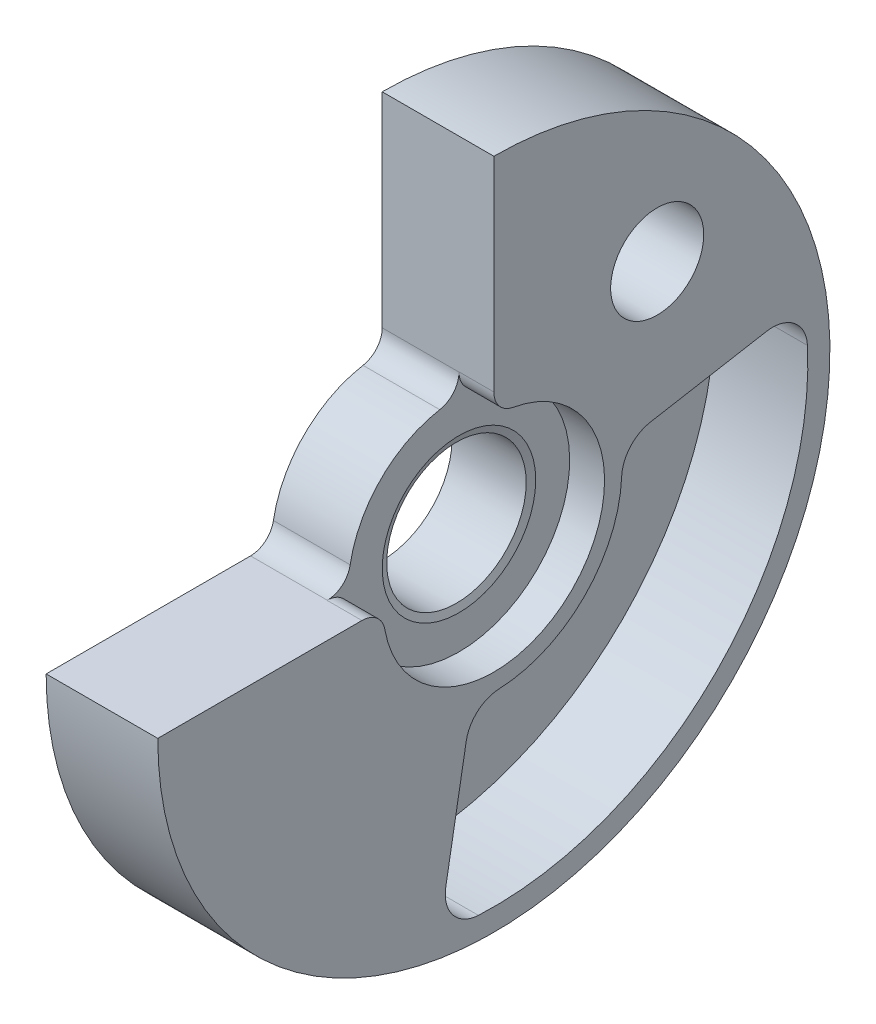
ISO-10303-21;
HEADER;
FILE_DESCRIPTION(('STEP AP214'),'2;1');
FILE_NAME('part.step','',(''),(''),'','','');
FILE_SCHEMA(('AUTOMOTIVE_DESIGN { 1 0 10303 214 1 1 1 1 }'));
ENDSEC;
DATA;
#1=APPLICATION_CONTEXT('core data for automotive mechanical design processes');
#2=APPLICATION_PROTOCOL_DEFINITION('international standard','automotive_design',2000,#1);
#3=PRODUCT_CONTEXT('',#1,'mechanical');
#4=PRODUCT('Part','Part','',(#3));
#5=PRODUCT_RELATED_PRODUCT_CATEGORY('part','',(#4));
#6=PRODUCT_DEFINITION_FORMATION('','',#4);
#7=PRODUCT_DEFINITION_CONTEXT('part definition',#1,'design');
#8=PRODUCT_DEFINITION('design','',#6,#7);
#9=PRODUCT_DEFINITION_SHAPE('','',#8);
#10=(LENGTH_UNIT() NAMED_UNIT(*) SI_UNIT(.MILLI.,.METRE.));
#11=(NAMED_UNIT(*) PLANE_ANGLE_UNIT() SI_UNIT($,.RADIAN.));
#12=(NAMED_UNIT(*) SI_UNIT($,.STERADIAN.) SOLID_ANGLE_UNIT());
#13=UNCERTAINTY_MEASURE_WITH_UNIT(LENGTH_MEASURE(1.E-05),#10,'distance_accuracy_value','');
#14=(GEOMETRIC_REPRESENTATION_CONTEXT(3) GLOBAL_UNCERTAINTY_ASSIGNED_CONTEXT((#13)) GLOBAL_UNIT_ASSIGNED_CONTEXT((#10,
#11,#12)) REPRESENTATION_CONTEXT('',''));
#15=CARTESIAN_POINT('',(0.,0.,0.));
#16=DIRECTION('',(0.,0.,1.));
#17=DIRECTION('',(1.,0.,0.));
#18=AXIS2_PLACEMENT_3D('',#15,#16,#17);
#19=CARTESIAN_POINT('',(0.,0.,0.));
#20=DIRECTION('',(1.,0.,0.));
#21=DIRECTION('',(0.,0.,-1.));
#22=AXIS2_PLACEMENT_3D('',#19,#20,#21);
#23=CYLINDRICAL_SURFACE('',#22,4.75);
#24=CARTESIAN_POINT('',(0.,0.,0.));
#25=DIRECTION('',(-1.,0.,0.));
#26=DIRECTION('',(0.,0.,-1.));
#27=AXIS2_PLACEMENT_3D('',#24,#25,#26);
#28=CIRCLE('',#27,4.75);
#29=CARTESIAN_POINT('',(0.,0.826086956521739,4.67761481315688));
#30=VERTEX_POINT('',#29);
#31=CARTESIAN_POINT('',(0.,4.67761481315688,0.826086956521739));
#32=VERTEX_POINT('',#31);
#33=EDGE_CURVE('E241',#30,#32,#28,.T.);
#34=ORIENTED_EDGE('',*,*,#33,.F.);
#35=DIRECTION('',(1.,0.,0.));
#36=VECTOR('',#35,1.);
#37=CARTESIAN_POINT('',(0.,0.826086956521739,4.67761481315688));
#38=LINE('',#37,#36);
#39=CARTESIAN_POINT('',(3.3,0.826086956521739,4.67761481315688));
#40=VERTEX_POINT('',#39);
#41=EDGE_CURVE('E270',#30,#40,#38,.T.);
#42=ORIENTED_EDGE('',*,*,#41,.T.);
#43=CARTESIAN_POINT('',(3.3,0.,0.));
#44=DIRECTION('',(1.,0.,0.));
#45=DIRECTION('',(0.,0.,-1.));
#46=AXIS2_PLACEMENT_3D('',#43,#44,#45);
#47=CIRCLE('',#46,4.75);
#48=CARTESIAN_POINT('',(3.3,4.67761481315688,0.826086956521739));
#49=VERTEX_POINT('',#48);
#50=EDGE_CURVE('E265',#49,#40,#47,.T.);
#51=ORIENTED_EDGE('',*,*,#50,.F.);
#52=DIRECTION('',(1.,0.,0.));
#53=VECTOR('',#52,1.);
#54=CARTESIAN_POINT('',(0.,4.67761481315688,0.826086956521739));
#55=LINE('',#54,#53);
#56=EDGE_CURVE('E268',#49,#32,#55,.F.);
#57=ORIENTED_EDGE('',*,*,#56,.T.);
#58=EDGE_LOOP('',(#34,#42,#51,#57));
#59=FACE_BOUND('',#58,.T.);
#60=ADVANCED_FACE('F35',(#59),#23,.T.);
#61=CARTESIAN_POINT('',(4.8,0.,0.));
#62=DIRECTION('',(-1.,0.,0.));
#63=DIRECTION('',(0.,0.,1.));
#64=AXIS2_PLACEMENT_3D('',#61,#62,#63);
#65=CYLINDRICAL_SURFACE('',#64,14.45);
#66=CARTESIAN_POINT('',(4.8,0.,0.));
#67=DIRECTION('',(1.,0.,0.));
#68=DIRECTION('',(0.,0.,-1.));
#69=AXIS2_PLACEMENT_3D('',#66,#67,#68);
#70=CIRCLE('',#69,14.45);
#71=CARTESIAN_POINT('',(4.8,0.,14.45));
#72=VERTEX_POINT('',#71);
#73=CARTESIAN_POINT('',(4.8,14.45,0.));
#74=VERTEX_POINT('',#73);
#75=EDGE_CURVE('E257',#72,#74,#70,.T.);
#76=ORIENTED_EDGE('',*,*,#75,.F.);
#77=DIRECTION('',(-1.,0.,0.));
#78=VECTOR('',#77,1.);
#79=CARTESIAN_POINT('',(4.8,0.,14.45));
#80=LINE('',#79,#78);
#81=CARTESIAN_POINT('',(0.,0.,14.45));
#82=VERTEX_POINT('',#81);
#83=EDGE_CURVE('E253',#72,#82,#80,.T.);
#84=ORIENTED_EDGE('',*,*,#83,.T.);
#85=CARTESIAN_POINT('',(0.,0.,0.));
#86=DIRECTION('',(1.,0.,0.));
#87=DIRECTION('',(0.,0.,-1.));
#88=AXIS2_PLACEMENT_3D('',#85,#86,#87);
#89=CIRCLE('',#88,14.45);
#90=CARTESIAN_POINT('',(0.,14.45,0.));
#91=VERTEX_POINT('',#90);
#92=EDGE_CURVE('E256',#82,#91,#89,.T.);
#93=ORIENTED_EDGE('',*,*,#92,.T.);
#94=DIRECTION('',(-1.,0.,0.));
#95=VECTOR('',#94,1.);
#96=CARTESIAN_POINT('',(4.8,14.45,0.));
#97=LINE('',#96,#95);
#98=EDGE_CURVE('E247',#91,#74,#97,.F.);
#99=ORIENTED_EDGE('',*,*,#98,.T.);
#100=EDGE_LOOP('',(#76,#84,#93,#99));
#101=FACE_BOUND('',#100,.T.);
#102=ADVANCED_FACE('F328',(#101),#65,.T.);
#103=CARTESIAN_POINT('',(4.8,0.,0.));
#104=DIRECTION('',(1.,0.,0.));
#105=DIRECTION('',(0.,0.,-1.));
#106=AXIS2_PLACEMENT_3D('',#103,#104,#105);
#107=PLANE('',#106);
#108=CARTESIAN_POINT('',(4.8,7.02157033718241,-7.02157033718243));
#109=DIRECTION('',(1.,0.,0.));
#110=DIRECTION('',(0.,0.,-1.));
#111=AXIS2_PLACEMENT_3D('',#108,#109,#110);
#112=CIRCLE('',#111,2.);
#113=CARTESIAN_POINT('',(4.8,7.02157033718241,-9.02157033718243));
#114=VERTEX_POINT('',#113);
#115=EDGE_CURVE('E583',#114,#114,#112,.T.);
#116=ORIENTED_EDGE('',*,*,#115,.F.);
#117=EDGE_LOOP('',(#116));
#118=FACE_BOUND('',#117,.T.);
#119=CARTESIAN_POINT('',(4.8,-11.9854760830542,0.590222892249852));
#120=DIRECTION('',(1.,0.,0.));
#121=DIRECTION('',(0.,0.,1.));
#122=AXIS2_PLACEMENT_3D('',#119,#120,#121);
#123=CIRCLE('',#122,1.5);
#124=CARTESIAN_POINT('',(4.8,-11.7250038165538,2.06743452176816));
#125=VERTEX_POINT('',#124);
#126=CARTESIAN_POINT('',(4.8,-13.483660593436,0.66400075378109));
#127=VERTEX_POINT('',#126);
#128=EDGE_CURVE('E50',#125,#127,#123,.T.);
#129=ORIENTED_EDGE('',*,*,#128,.F.);
#130=DIRECTION('',(0.,-0.984807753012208,0.173648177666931));
#131=VECTOR('',#130,1.);
#132=CARTESIAN_POINT('',(4.8,-6.73352173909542,1.18730155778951));
#133=LINE('',#132,#131);
#134=CARTESIAN_POINT('',(4.8,-6.73352173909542,1.18730155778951));
#135=VERTEX_POINT('',#134);
#136=EDGE_CURVE('E182',#135,#125,#133,.T.);
#137=ORIENTED_EDGE('',*,*,#136,.F.);
#138=CARTESIAN_POINT('',(4.8,-6.99399400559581,-0.289910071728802));
#139=DIRECTION('',(1.,0.,0.));
#140=DIRECTION('',(0.,0.,1.));
#141=AXIS2_PLACEMENT_3D('',#138,#139,#140);
#142=CIRCLE('',#141,1.5);
#143=CARTESIAN_POINT('',(4.8,-5.49528100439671,-0.227786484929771));
#144=VERTEX_POINT('',#143);
#145=EDGE_CURVE('E185',#144,#135,#142,.T.);
#146=ORIENTED_EDGE('',*,*,#145,.F.);
#147=CARTESIAN_POINT('',(4.8,0.,0.));
#148=DIRECTION('',(-1.,0.,0.));
#149=DIRECTION('',(0.,0.,-1.));
#150=AXIS2_PLACEMENT_3D('',#147,#148,#149);
#151=CIRCLE('',#150,5.5);
#152=CARTESIAN_POINT('',(4.8,-0.22778648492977,-5.49528100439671));
#153=VERTEX_POINT('',#152);
#154=EDGE_CURVE('E216',#153,#144,#151,.T.);
#155=ORIENTED_EDGE('',*,*,#154,.F.);
#156=CARTESIAN_POINT('',(4.8,-0.289910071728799,-6.99399400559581));
#157=DIRECTION('',(1.,0.,0.));
#158=DIRECTION('',(0.,0.,-1.));
#159=AXIS2_PLACEMENT_3D('',#156,#157,#158);
#160=CIRCLE('',#159,1.5);
#161=CARTESIAN_POINT('',(4.8,1.18730155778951,-6.73352173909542));
#162=VERTEX_POINT('',#161);
#163=EDGE_CURVE('E213',#162,#153,#160,.T.);
#164=ORIENTED_EDGE('',*,*,#163,.F.);
#165=DIRECTION('',(0.,-0.173648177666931,0.984807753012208));
#166=VECTOR('',#165,1.);
#167=CARTESIAN_POINT('',(4.8,1.18730155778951,-6.73352173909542));
#168=LINE('',#167,#166);
#169=CARTESIAN_POINT('',(4.8,2.06743452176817,-11.7250038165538));
#170=VERTEX_POINT('',#169);
#171=EDGE_CURVE('E210',#170,#162,#168,.T.);
#172=ORIENTED_EDGE('',*,*,#171,.F.);
#173=CARTESIAN_POINT('',(4.8,0.590222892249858,-11.9854760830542));
#174=DIRECTION('',(1.,0.,0.));
#175=DIRECTION('',(0.,0.,-1.));
#176=AXIS2_PLACEMENT_3D('',#173,#174,#175);
#177=CIRCLE('',#176,1.5);
#178=CARTESIAN_POINT('',(4.8,0.664000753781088,-13.483660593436));
#179=VERTEX_POINT('',#178);
#180=EDGE_CURVE('E207',#179,#170,#177,.T.);
#181=ORIENTED_EDGE('',*,*,#180,.F.);
#182=CARTESIAN_POINT('',(4.8,0.,0.));
#183=DIRECTION('',(1.,0.,0.));
#184=DIRECTION('',(0.,0.,-1.));
#185=AXIS2_PLACEMENT_3D('',#182,#183,#184);
#186=CIRCLE('',#185,13.5);
#187=EDGE_CURVE('E205',#127,#179,#186,.T.);
#188=ORIENTED_EDGE('',*,*,#187,.F.);
#189=EDGE_LOOP('',(#129,#137,#146,#155,#164,#172,#181,#188));
#190=FACE_BOUND('',#189,.T.);
#191=CARTESIAN_POINT('',(4.8,0.,0.));
#192=DIRECTION('',(1.,0.,0.));
#193=DIRECTION('',(0.,0.,-1.));
#194=AXIS2_PLACEMENT_3D('',#191,#192,#193);
#195=CIRCLE('',#194,4.76);
#196=CARTESIAN_POINT('',(4.8,-0.826388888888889,4.68771601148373));
#197=VERTEX_POINT('',#196);
#198=CARTESIAN_POINT('',(4.8,4.68771601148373,-0.826388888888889));
#199=VERTEX_POINT('',#198);
#200=EDGE_CURVE('E223',#197,#199,#195,.T.);
#201=ORIENTED_EDGE('',*,*,#200,.F.);
#202=CARTESIAN_POINT('',(4.8,-1.,5.67253029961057));
#203=DIRECTION('',(1.,0.,0.));
#204=DIRECTION('',(0.,0.,-1.));
#205=AXIS2_PLACEMENT_3D('',#202,#203,#204);
#206=CIRCLE('',#205,1.);
#207=CARTESIAN_POINT('',(4.8,0.,5.67253029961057));
#208=VERTEX_POINT('',#207);
#209=EDGE_CURVE('E293',#197,#208,#206,.T.);
#210=ORIENTED_EDGE('',*,*,#209,.T.);
#211=DIRECTION('',(0.,0.,-1.));
#212=VECTOR('',#211,1.);
#213=CARTESIAN_POINT('',(4.8,0.,4.75));
#214=LINE('',#213,#212);
#215=EDGE_CURVE('E245',#72,#208,#214,.T.);
#216=ORIENTED_EDGE('',*,*,#215,.F.);
#217=ORIENTED_EDGE('',*,*,#75,.T.);
#218=DIRECTION('',(0.,1.,0.));
#219=VECTOR('',#218,1.);
#220=CARTESIAN_POINT('',(4.8,4.75,0.));
#221=LINE('',#220,#219);
#222=CARTESIAN_POINT('',(4.8,5.67253029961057,0.));
#223=VERTEX_POINT('',#222);
#224=EDGE_CURVE('E238',#223,#74,#221,.T.);
#225=ORIENTED_EDGE('',*,*,#224,.F.);
#226=CARTESIAN_POINT('',(4.8,5.67253029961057,-1.));
#227=DIRECTION('',(1.,0.,0.));
#228=DIRECTION('',(0.,0.,-1.));
#229=AXIS2_PLACEMENT_3D('',#226,#227,#228);
#230=CIRCLE('',#229,1.);
#231=EDGE_CURVE('E291',#223,#199,#230,.T.);
#232=ORIENTED_EDGE('',*,*,#231,.T.);
#233=EDGE_LOOP('',(#201,#210,#216,#217,#225,#232));
#234=FACE_BOUND('',#233,.T.);
#235=ADVANCED_FACE('F334',(#118,#190,#234),#107,.T.);
#236=CARTESIAN_POINT('',(0.,0.,0.));
#237=DIRECTION('',(1.,0.,0.));
#238=DIRECTION('',(0.,0.,-1.));
#239=AXIS2_PLACEMENT_3D('',#236,#237,#238);
#240=PLANE('',#239);
#241=CARTESIAN_POINT('',(0.,7.02157033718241,-7.02157033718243));
#242=DIRECTION('',(1.,0.,0.));
#243=DIRECTION('',(0.,0.,-1.));
#244=AXIS2_PLACEMENT_3D('',#241,#242,#243);
#245=CIRCLE('',#244,2.);
#246=CARTESIAN_POINT('',(0.,7.02157033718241,-9.02157033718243));
#247=VERTEX_POINT('',#246);
#248=EDGE_CURVE('E580',#247,#247,#245,.T.);
#249=ORIENTED_EDGE('',*,*,#248,.T.);
#250=EDGE_LOOP('',(#249));
#251=FACE_BOUND('',#250,.T.);
#252=CARTESIAN_POINT('',(0.,0.,0.));
#253=DIRECTION('',(1.,0.,0.));
#254=DIRECTION('',(0.,0.,-1.));
#255=AXIS2_PLACEMENT_3D('',#252,#253,#254);
#256=CIRCLE('',#255,3.);
#257=CARTESIAN_POINT('',(0.,0.,-3.));
#258=VERTEX_POINT('',#257);
#259=EDGE_CURVE('E188',#258,#258,#256,.F.);
#260=ORIENTED_EDGE('',*,*,#259,.F.);
#261=EDGE_LOOP('',(#260));
#262=FACE_BOUND('',#261,.T.);
#263=ORIENTED_EDGE('',*,*,#92,.F.);
#264=DIRECTION('',(0.,0.,-1.));
#265=VECTOR('',#264,1.);
#266=CARTESIAN_POINT('',(0.,0.,0.));
#267=LINE('',#266,#265);
#268=CARTESIAN_POINT('',(0.,0.,5.66237582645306));
#269=VERTEX_POINT('',#268);
#270=EDGE_CURVE('E260',#82,#269,#267,.T.);
#271=ORIENTED_EDGE('',*,*,#270,.T.);
#272=CARTESIAN_POINT('',(0.,1.,5.66237582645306));
#273=DIRECTION('',(1.,0.,0.));
#274=DIRECTION('',(0.,0.,-1.));
#275=AXIS2_PLACEMENT_3D('',#272,#273,#274);
#276=CIRCLE('',#275,1.);
#277=EDGE_CURVE('E280',#269,#30,#276,.T.);
#278=ORIENTED_EDGE('',*,*,#277,.T.);
#279=ORIENTED_EDGE('',*,*,#33,.T.);
#280=CARTESIAN_POINT('',(0.,5.66237582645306,1.));
#281=DIRECTION('',(1.,0.,0.));
#282=DIRECTION('',(0.,0.,-1.));
#283=AXIS2_PLACEMENT_3D('',#280,#281,#282);
#284=CIRCLE('',#283,1.);
#285=CARTESIAN_POINT('',(0.,5.66237582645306,0.));
#286=VERTEX_POINT('',#285);
#287=EDGE_CURVE('E283',#32,#286,#284,.T.);
#288=ORIENTED_EDGE('',*,*,#287,.T.);
#289=DIRECTION('',(0.,1.,0.));
#290=VECTOR('',#289,1.);
#291=CARTESIAN_POINT('',(0.,4.75,0.));
#292=LINE('',#291,#290);
#293=EDGE_CURVE('E244',#286,#91,#292,.T.);
#294=ORIENTED_EDGE('',*,*,#293,.T.);
#295=EDGE_LOOP('',(#263,#271,#278,#279,#288,#294));
#296=FACE_BOUND('',#295,.T.);
#297=ADVANCED_FACE('F344',(#251,#262,#296),#240,.F.);
#298=CARTESIAN_POINT('',(0.,0.,4.75));
#299=DIRECTION('',(0.,-1.,0.));
#300=DIRECTION('',(0.,0.,-1.));
#301=AXIS2_PLACEMENT_3D('',#298,#299,#300);
#302=PLANE('',#301);
#303=ORIENTED_EDGE('',*,*,#215,.T.);
#304=DIRECTION('',(1.,0.,0.));
#305=VECTOR('',#304,1.);
#306=CARTESIAN_POINT('',(0.,0.,5.67253029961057));
#307=LINE('',#306,#305);
#308=CARTESIAN_POINT('',(3.3,0.,5.67253029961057));
#309=VERTEX_POINT('',#308);
#310=EDGE_CURVE('E298',#208,#309,#307,.F.);
#311=ORIENTED_EDGE('',*,*,#310,.T.);
#312=DIRECTION('',(0.,0.,-1.));
#313=VECTOR('',#312,1.);
#314=CARTESIAN_POINT('',(3.3,0.,0.));
#315=LINE('',#314,#313);
#316=CARTESIAN_POINT('',(3.3,0.,5.66237582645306));
#317=VERTEX_POINT('',#316);
#318=EDGE_CURVE('E295',#309,#317,#315,.T.);
#319=ORIENTED_EDGE('',*,*,#318,.T.);
#320=DIRECTION('',(-1.,0.,0.));
#321=VECTOR('',#320,1.);
#322=CARTESIAN_POINT('',(0.,0.,5.66237582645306));
#323=LINE('',#322,#321);
#324=EDGE_CURVE('E273',#317,#269,#323,.T.);
#325=ORIENTED_EDGE('',*,*,#324,.T.);
#326=ORIENTED_EDGE('',*,*,#270,.F.);
#327=ORIENTED_EDGE('',*,*,#83,.F.);
#328=EDGE_LOOP('',(#303,#311,#319,#325,#326,#327));
#329=FACE_BOUND('',#328,.T.);
#330=ADVANCED_FACE('F347',(#329),#302,.F.);
#331=CARTESIAN_POINT('',(0.,4.75,0.));
#332=DIRECTION('',(0.,0.,-1.));
#333=DIRECTION('',(-1.,0.,0.));
#334=AXIS2_PLACEMENT_3D('',#331,#332,#333);
#335=PLANE('',#334);
#336=DIRECTION('',(-1.,0.,0.));
#337=VECTOR('',#336,1.);
#338=CARTESIAN_POINT('',(3.3,5.66237582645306,0.));
#339=LINE('',#338,#337);
#340=CARTESIAN_POINT('',(3.3,5.66237582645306,0.));
#341=VERTEX_POINT('',#340);
#342=EDGE_CURVE('E275',#286,#341,#339,.F.);
#343=ORIENTED_EDGE('',*,*,#342,.T.);
#344=DIRECTION('',(0.,1.,0.));
#345=VECTOR('',#344,1.);
#346=CARTESIAN_POINT('',(3.3,0.,0.));
#347=LINE('',#346,#345);
#348=CARTESIAN_POINT('',(3.3,5.67253029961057,0.));
#349=VERTEX_POINT('',#348);
#350=EDGE_CURVE('E303',#341,#349,#347,.T.);
#351=ORIENTED_EDGE('',*,*,#350,.T.);
#352=DIRECTION('',(1.,0.,0.));
#353=VECTOR('',#352,1.);
#354=CARTESIAN_POINT('',(0.,5.67253029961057,0.));
#355=LINE('',#354,#353);
#356=EDGE_CURVE('E301',#349,#223,#355,.T.);
#357=ORIENTED_EDGE('',*,*,#356,.T.);
#358=ORIENTED_EDGE('',*,*,#224,.T.);
#359=ORIENTED_EDGE('',*,*,#98,.F.);
#360=ORIENTED_EDGE('',*,*,#293,.F.);
#361=EDGE_LOOP('',(#343,#351,#357,#358,#359,#360));
#362=FACE_BOUND('',#361,.T.);
#363=ADVANCED_FACE('F340',(#362),#335,.F.);
#364=CARTESIAN_POINT('',(3.3,0.,0.));
#365=DIRECTION('',(1.,0.,0.));
#366=DIRECTION('',(0.,0.,-1.));
#367=AXIS2_PLACEMENT_3D('',#364,#365,#366);
#368=CYLINDRICAL_SURFACE('',#367,4.76);
#369=CARTESIAN_POINT('',(3.3,0.,0.));
#370=DIRECTION('',(1.,0.,0.));
#371=DIRECTION('',(0.,0.,-1.));
#372=AXIS2_PLACEMENT_3D('',#369,#370,#371);
#373=CIRCLE('',#372,4.76);
#374=CARTESIAN_POINT('',(3.3,-0.826388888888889,4.68771601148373));
#375=VERTEX_POINT('',#374);
#376=CARTESIAN_POINT('',(3.3,4.68771601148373,-0.826388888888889));
#377=VERTEX_POINT('',#376);
#378=EDGE_CURVE('E235',#375,#377,#373,.T.);
#379=ORIENTED_EDGE('',*,*,#378,.F.);
#380=DIRECTION('',(1.,0.,0.));
#381=VECTOR('',#380,1.);
#382=CARTESIAN_POINT('',(3.3,-0.826388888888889,4.68771601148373));
#383=LINE('',#382,#381);
#384=EDGE_CURVE('E288',#375,#197,#383,.T.);
#385=ORIENTED_EDGE('',*,*,#384,.T.);
#386=ORIENTED_EDGE('',*,*,#200,.T.);
#387=DIRECTION('',(1.,0.,0.));
#388=VECTOR('',#387,1.);
#389=CARTESIAN_POINT('',(3.3,4.68771601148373,-0.826388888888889));
#390=LINE('',#389,#388);
#391=EDGE_CURVE('E285',#199,#377,#390,.F.);
#392=ORIENTED_EDGE('',*,*,#391,.T.);
#393=EDGE_LOOP('',(#379,#385,#386,#392));
#394=FACE_BOUND('',#393,.T.);
#395=ADVANCED_FACE('F377',(#394),#368,.F.);
#396=CARTESIAN_POINT('',(3.3,0.,0.));
#397=DIRECTION('',(1.,0.,0.));
#398=DIRECTION('',(0.,0.,-1.));
#399=AXIS2_PLACEMENT_3D('',#396,#397,#398);
#400=PLANE('',#399);
#401=CARTESIAN_POINT('',(3.3,0.,0.));
#402=DIRECTION('',(1.,0.,0.));
#403=DIRECTION('',(0.,0.,-1.));
#404=AXIS2_PLACEMENT_3D('',#401,#402,#403);
#405=CIRCLE('',#404,3.30000000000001);
#406=CARTESIAN_POINT('',(3.3,0.,-3.30000000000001));
#407=VERTEX_POINT('',#406);
#408=EDGE_CURVE('E11',#407,#407,#405,.F.);
#409=ORIENTED_EDGE('',*,*,#408,.T.);
#410=EDGE_LOOP('',(#409));
#411=FACE_BOUND('',#410,.T.);
#412=ORIENTED_EDGE('',*,*,#50,.T.);
#413=CARTESIAN_POINT('',(3.3,1.,5.66237582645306));
#414=DIRECTION('',(1.,0.,0.));
#415=DIRECTION('',(0.,0.,-1.));
#416=AXIS2_PLACEMENT_3D('',#413,#414,#415);
#417=CIRCLE('',#416,1.);
#418=EDGE_CURVE('E278',#40,#317,#417,.F.);
#419=ORIENTED_EDGE('',*,*,#418,.T.);
#420=ORIENTED_EDGE('',*,*,#318,.F.);
#421=CARTESIAN_POINT('',(3.3,-1.,5.67253029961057));
#422=DIRECTION('',(1.,0.,0.));
#423=DIRECTION('',(0.,0.,-1.));
#424=AXIS2_PLACEMENT_3D('',#421,#422,#423);
#425=CIRCLE('',#424,1.);
#426=EDGE_CURVE('E306',#309,#375,#425,.F.);
#427=ORIENTED_EDGE('',*,*,#426,.T.);
#428=ORIENTED_EDGE('',*,*,#378,.T.);
#429=CARTESIAN_POINT('',(3.3,5.67253029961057,-1.));
#430=DIRECTION('',(1.,0.,0.));
#431=DIRECTION('',(0.,0.,-1.));
#432=AXIS2_PLACEMENT_3D('',#429,#430,#431);
#433=CIRCLE('',#432,1.);
#434=EDGE_CURVE('E308',#377,#349,#433,.F.);
#435=ORIENTED_EDGE('',*,*,#434,.T.);
#436=ORIENTED_EDGE('',*,*,#350,.F.);
#437=CARTESIAN_POINT('',(3.3,5.66237582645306,1.));
#438=DIRECTION('',(1.,0.,0.));
#439=DIRECTION('',(0.,0.,-1.));
#440=AXIS2_PLACEMENT_3D('',#437,#438,#439);
#441=CIRCLE('',#440,1.);
#442=EDGE_CURVE('E58',#341,#49,#441,.F.);
#443=ORIENTED_EDGE('',*,*,#442,.T.);
#444=EDGE_LOOP('',(#412,#419,#420,#427,#428,#435,#436,#443));
#445=FACE_BOUND('',#444,.T.);
#446=ADVANCED_FACE('F354',(#411,#445),#400,.T.);
#447=CARTESIAN_POINT('',(0.,1.,5.66237582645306));
#448=DIRECTION('',(1.,0.,0.));
#449=DIRECTION('',(0.,0.,-1.));
#450=AXIS2_PLACEMENT_3D('',#447,#448,#449);
#451=CYLINDRICAL_SURFACE('',#450,1.);
#452=ORIENTED_EDGE('',*,*,#324,.F.);
#453=ORIENTED_EDGE('',*,*,#418,.F.);
#454=ORIENTED_EDGE('',*,*,#41,.F.);
#455=ORIENTED_EDGE('',*,*,#277,.F.);
#456=EDGE_LOOP('',(#452,#453,#454,#455));
#457=FACE_BOUND('',#456,.T.);
#458=ADVANCED_FACE('F350',(#457),#451,.F.);
#459=CARTESIAN_POINT('',(0.,5.66237582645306,1.));
#460=DIRECTION('',(1.,0.,0.));
#461=DIRECTION('',(0.,0.,-1.));
#462=AXIS2_PLACEMENT_3D('',#459,#460,#461);
#463=CYLINDRICAL_SURFACE('',#462,1.);
#464=ORIENTED_EDGE('',*,*,#442,.F.);
#465=ORIENTED_EDGE('',*,*,#342,.F.);
#466=ORIENTED_EDGE('',*,*,#287,.F.);
#467=ORIENTED_EDGE('',*,*,#56,.F.);
#468=EDGE_LOOP('',(#464,#465,#466,#467));
#469=FACE_BOUND('',#468,.T.);
#470=ADVANCED_FACE('F353',(#469),#463,.F.);
#471=CARTESIAN_POINT('',(3.3,-1.,5.67253029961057));
#472=DIRECTION('',(1.,0.,0.));
#473=DIRECTION('',(0.,0.,-1.));
#474=AXIS2_PLACEMENT_3D('',#471,#472,#473);
#475=CYLINDRICAL_SURFACE('',#474,1.);
#476=ORIENTED_EDGE('',*,*,#426,.F.);
#477=ORIENTED_EDGE('',*,*,#310,.F.);
#478=ORIENTED_EDGE('',*,*,#209,.F.);
#479=ORIENTED_EDGE('',*,*,#384,.F.);
#480=EDGE_LOOP('',(#476,#477,#478,#479));
#481=FACE_BOUND('',#480,.T.);
#482=ADVANCED_FACE('F358',(#481),#475,.T.);
#483=CARTESIAN_POINT('',(3.3,5.67253029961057,-1.));
#484=DIRECTION('',(1.,0.,0.));
#485=DIRECTION('',(0.,0.,-1.));
#486=AXIS2_PLACEMENT_3D('',#483,#484,#485);
#487=CYLINDRICAL_SURFACE('',#486,1.);
#488=ORIENTED_EDGE('',*,*,#231,.F.);
#489=ORIENTED_EDGE('',*,*,#356,.F.);
#490=ORIENTED_EDGE('',*,*,#434,.F.);
#491=ORIENTED_EDGE('',*,*,#391,.F.);
#492=EDGE_LOOP('',(#488,#489,#490,#491));
#493=FACE_BOUND('',#492,.T.);
#494=ADVANCED_FACE('F360',(#493),#487,.T.);
#495=CARTESIAN_POINT('',(0.799999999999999,-11.9854760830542,0.590222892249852));
#496=DIRECTION('',(1.,0.,0.));
#497=DIRECTION('',(0.,0.,-1.));
#498=AXIS2_PLACEMENT_3D('',#495,#496,#497);
#499=CYLINDRICAL_SURFACE('',#498,1.5);
#500=ORIENTED_EDGE('',*,*,#128,.T.);
#501=DIRECTION('',(1.,0.,0.));
#502=VECTOR('',#501,1.);
#503=CARTESIAN_POINT('',(0.799999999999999,-13.483660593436,0.66400075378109));
#504=LINE('',#503,#502);
#505=CARTESIAN_POINT('',(0.799999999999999,-13.483660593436,0.66400075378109));
#506=VERTEX_POINT('',#505);
#507=EDGE_CURVE('E159',#506,#127,#504,.T.);
#508=ORIENTED_EDGE('',*,*,#507,.F.);
#509=CARTESIAN_POINT('',(0.799999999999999,-11.9854760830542,0.590222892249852));
#510=DIRECTION('',(1.,0.,0.));
#511=DIRECTION('',(0.,0.,1.));
#512=AXIS2_PLACEMENT_3D('',#509,#510,#511);
#513=CIRCLE('',#512,1.5);
#514=CARTESIAN_POINT('',(0.799999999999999,-11.7250038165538,2.06743452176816));
#515=VERTEX_POINT('',#514);
#516=EDGE_CURVE('E163',#515,#506,#513,.T.);
#517=ORIENTED_EDGE('',*,*,#516,.F.);
#518=DIRECTION('',(1.,0.,0.));
#519=VECTOR('',#518,1.);
#520=CARTESIAN_POINT('',(0.799999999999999,-11.7250038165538,2.06743452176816));
#521=LINE('',#520,#519);
#522=EDGE_CURVE('E221',#515,#125,#521,.T.);
#523=ORIENTED_EDGE('',*,*,#522,.T.);
#524=EDGE_LOOP('',(#500,#508,#517,#523));
#525=FACE_BOUND('',#524,.T.);
#526=ADVANCED_FACE('F161',(#525),#499,.F.);
#527=CARTESIAN_POINT('',(0.799999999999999,-6.73352173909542,1.18730155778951));
#528=DIRECTION('',(0.,0.173648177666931,0.984807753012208));
#529=DIRECTION('',(0.,-0.984807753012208,0.173648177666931));
#530=AXIS2_PLACEMENT_3D('',#527,#528,#529);
#531=PLANE('',#530);
#532=ORIENTED_EDGE('',*,*,#136,.T.);
#533=ORIENTED_EDGE('',*,*,#522,.F.);
#534=DIRECTION('',(0.,-0.984807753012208,0.173648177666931));
#535=VECTOR('',#534,1.);
#536=CARTESIAN_POINT('',(0.799999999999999,-6.73352173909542,1.18730155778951));
#537=LINE('',#536,#535);
#538=CARTESIAN_POINT('',(0.799999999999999,-6.73352173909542,1.18730155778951));
#539=VERTEX_POINT('',#538);
#540=EDGE_CURVE('E169',#539,#515,#537,.T.);
#541=ORIENTED_EDGE('',*,*,#540,.F.);
#542=DIRECTION('',(1.,0.,0.));
#543=VECTOR('',#542,1.);
#544=CARTESIAN_POINT('',(0.799999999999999,-6.73352173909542,1.18730155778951));
#545=LINE('',#544,#543);
#546=EDGE_CURVE('E224',#539,#135,#545,.T.);
#547=ORIENTED_EDGE('',*,*,#546,.T.);
#548=EDGE_LOOP('',(#532,#533,#541,#547));
#549=FACE_BOUND('',#548,.T.);
#550=ADVANCED_FACE('F367',(#549),#531,.F.);
#551=CARTESIAN_POINT('',(0.799999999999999,-6.99399400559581,-0.289910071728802));
#552=DIRECTION('',(1.,0.,0.));
#553=DIRECTION('',(0.,0.,-1.));
#554=AXIS2_PLACEMENT_3D('',#551,#552,#553);
#555=CYLINDRICAL_SURFACE('',#554,1.5);
#556=ORIENTED_EDGE('',*,*,#145,.T.);
#557=ORIENTED_EDGE('',*,*,#546,.F.);
#558=CARTESIAN_POINT('',(0.799999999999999,-6.99399400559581,-0.289910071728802));
#559=DIRECTION('',(1.,0.,0.));
#560=DIRECTION('',(0.,0.,1.));
#561=AXIS2_PLACEMENT_3D('',#558,#559,#560);
#562=CIRCLE('',#561,1.5);
#563=CARTESIAN_POINT('',(0.799999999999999,-5.49528100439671,-0.227786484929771));
#564=VERTEX_POINT('',#563);
#565=EDGE_CURVE('E201',#564,#539,#562,.T.);
#566=ORIENTED_EDGE('',*,*,#565,.F.);
#567=DIRECTION('',(1.,0.,0.));
#568=VECTOR('',#567,1.);
#569=CARTESIAN_POINT('',(0.799999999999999,-5.49528100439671,-0.227786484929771));
#570=LINE('',#569,#568);
#571=EDGE_CURVE('E226',#564,#144,#570,.T.);
#572=ORIENTED_EDGE('',*,*,#571,.T.);
#573=EDGE_LOOP('',(#556,#557,#566,#572));
#574=FACE_BOUND('',#573,.T.);
#575=ADVANCED_FACE('F450',(#574),#555,.F.);
#576=CARTESIAN_POINT('',(0.799999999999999,0.,0.));
#577=DIRECTION('',(1.,0.,0.));
#578=DIRECTION('',(0.,0.,-1.));
#579=AXIS2_PLACEMENT_3D('',#576,#577,#578);
#580=CYLINDRICAL_SURFACE('',#579,5.5);
#581=ORIENTED_EDGE('',*,*,#154,.T.);
#582=ORIENTED_EDGE('',*,*,#571,.F.);
#583=CARTESIAN_POINT('',(0.799999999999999,0.,0.));
#584=DIRECTION('',(-1.,0.,0.));
#585=DIRECTION('',(0.,0.,-1.));
#586=AXIS2_PLACEMENT_3D('',#583,#584,#585);
#587=CIRCLE('',#586,5.5);
#588=CARTESIAN_POINT('',(0.799999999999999,-0.22778648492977,-5.49528100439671));
#589=VERTEX_POINT('',#588);
#590=EDGE_CURVE('E198',#589,#564,#587,.T.);
#591=ORIENTED_EDGE('',*,*,#590,.F.);
#592=DIRECTION('',(1.,0.,0.));
#593=VECTOR('',#592,1.);
#594=CARTESIAN_POINT('',(0.799999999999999,-0.22778648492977,-5.49528100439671));
#595=LINE('',#594,#593);
#596=EDGE_CURVE('E228',#589,#153,#595,.T.);
#597=ORIENTED_EDGE('',*,*,#596,.T.);
#598=EDGE_LOOP('',(#581,#582,#591,#597));
#599=FACE_BOUND('',#598,.T.);
#600=ADVANCED_FACE('F460',(#599),#580,.T.);
#601=CARTESIAN_POINT('',(0.799999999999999,-0.289910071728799,-6.99399400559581));
#602=DIRECTION('',(1.,0.,0.));
#603=DIRECTION('',(0.,0.,-1.));
#604=AXIS2_PLACEMENT_3D('',#601,#602,#603);
#605=CYLINDRICAL_SURFACE('',#604,1.5);
#606=ORIENTED_EDGE('',*,*,#163,.T.);
#607=ORIENTED_EDGE('',*,*,#596,.F.);
#608=CARTESIAN_POINT('',(0.799999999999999,-0.289910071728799,-6.99399400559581));
#609=DIRECTION('',(1.,0.,0.));
#610=DIRECTION('',(0.,0.,-1.));
#611=AXIS2_PLACEMENT_3D('',#608,#609,#610);
#612=CIRCLE('',#611,1.5);
#613=CARTESIAN_POINT('',(0.799999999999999,1.18730155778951,-6.73352173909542));
#614=VERTEX_POINT('',#613);
#615=EDGE_CURVE('E195',#614,#589,#612,.T.);
#616=ORIENTED_EDGE('',*,*,#615,.F.);
#617=DIRECTION('',(1.,0.,0.));
#618=VECTOR('',#617,1.);
#619=CARTESIAN_POINT('',(0.799999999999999,1.18730155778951,-6.73352173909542));
#620=LINE('',#619,#618);
#621=EDGE_CURVE('E230',#614,#162,#620,.T.);
#622=ORIENTED_EDGE('',*,*,#621,.T.);
#623=EDGE_LOOP('',(#606,#607,#616,#622));
#624=FACE_BOUND('',#623,.T.);
#625=ADVANCED_FACE('F470',(#624),#605,.F.);
#626=CARTESIAN_POINT('',(0.799999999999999,1.18730155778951,-6.73352173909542));
#627=DIRECTION('',(0.,0.984807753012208,0.173648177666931));
#628=DIRECTION('',(0.,-0.173648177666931,0.984807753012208));
#629=AXIS2_PLACEMENT_3D('',#626,#627,#628);
#630=PLANE('',#629);
#631=ORIENTED_EDGE('',*,*,#171,.T.);
#632=ORIENTED_EDGE('',*,*,#621,.F.);
#633=DIRECTION('',(0.,-0.173648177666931,0.984807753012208));
#634=VECTOR('',#633,1.);
#635=CARTESIAN_POINT('',(0.799999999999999,1.18730155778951,-6.73352173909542));
#636=LINE('',#635,#634);
#637=CARTESIAN_POINT('',(0.799999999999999,2.06743452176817,-11.7250038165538));
#638=VERTEX_POINT('',#637);
#639=EDGE_CURVE('E192',#638,#614,#636,.T.);
#640=ORIENTED_EDGE('',*,*,#639,.F.);
#641=DIRECTION('',(1.,0.,0.));
#642=VECTOR('',#641,1.);
#643=CARTESIAN_POINT('',(0.799999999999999,2.06743452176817,-11.7250038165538));
#644=LINE('',#643,#642);
#645=EDGE_CURVE('E232',#638,#170,#644,.T.);
#646=ORIENTED_EDGE('',*,*,#645,.T.);
#647=EDGE_LOOP('',(#631,#632,#640,#646));
#648=FACE_BOUND('',#647,.T.);
#649=ADVANCED_FACE('F480',(#648),#630,.F.);
#650=CARTESIAN_POINT('',(0.799999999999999,0.590222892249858,-11.9854760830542));
#651=DIRECTION('',(1.,0.,0.));
#652=DIRECTION('',(0.,0.,-1.));
#653=AXIS2_PLACEMENT_3D('',#650,#651,#652);
#654=CYLINDRICAL_SURFACE('',#653,1.5);
#655=ORIENTED_EDGE('',*,*,#180,.T.);
#656=ORIENTED_EDGE('',*,*,#645,.F.);
#657=CARTESIAN_POINT('',(0.799999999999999,0.590222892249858,-11.9854760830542));
#658=DIRECTION('',(1.,0.,0.));
#659=DIRECTION('',(0.,0.,-1.));
#660=AXIS2_PLACEMENT_3D('',#657,#658,#659);
#661=CIRCLE('',#660,1.5);
#662=CARTESIAN_POINT('',(0.799999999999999,0.664000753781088,-13.483660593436));
#663=VERTEX_POINT('',#662);
#664=EDGE_CURVE('E177',#663,#638,#661,.T.);
#665=ORIENTED_EDGE('',*,*,#664,.F.);
#666=DIRECTION('',(1.,0.,0.));
#667=VECTOR('',#666,1.);
#668=CARTESIAN_POINT('',(0.799999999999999,0.664000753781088,-13.483660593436));
#669=LINE('',#668,#667);
#670=EDGE_CURVE('E168',#663,#179,#669,.T.);
#671=ORIENTED_EDGE('',*,*,#670,.T.);
#672=EDGE_LOOP('',(#655,#656,#665,#671));
#673=FACE_BOUND('',#672,.T.);
#674=ADVANCED_FACE('F490',(#673),#654,.F.);
#675=CARTESIAN_POINT('',(0.799999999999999,0.,0.));
#676=DIRECTION('',(1.,0.,0.));
#677=DIRECTION('',(0.,0.,-1.));
#678=AXIS2_PLACEMENT_3D('',#675,#676,#677);
#679=CYLINDRICAL_SURFACE('',#678,13.5);
#680=ORIENTED_EDGE('',*,*,#187,.T.);
#681=ORIENTED_EDGE('',*,*,#670,.F.);
#682=CARTESIAN_POINT('',(0.799999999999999,0.,0.));
#683=DIRECTION('',(1.,0.,0.));
#684=DIRECTION('',(0.,0.,-1.));
#685=AXIS2_PLACEMENT_3D('',#682,#683,#684);
#686=CIRCLE('',#685,13.5);
#687=EDGE_CURVE('E172',#506,#663,#686,.T.);
#688=ORIENTED_EDGE('',*,*,#687,.F.);
#689=ORIENTED_EDGE('',*,*,#507,.T.);
#690=EDGE_LOOP('',(#680,#681,#688,#689));
#691=FACE_BOUND('',#690,.T.);
#692=ADVANCED_FACE('F173',(#691),#679,.F.);
#693=CARTESIAN_POINT('',(0.799999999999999,-11.9854760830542,0.590222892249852));
#694=DIRECTION('',(-1.,0.,0.));
#695=DIRECTION('',(0.,0.,1.));
#696=AXIS2_PLACEMENT_3D('',#693,#694,#695);
#697=PLANE('',#696);
#698=ORIENTED_EDGE('',*,*,#516,.T.);
#699=ORIENTED_EDGE('',*,*,#687,.T.);
#700=ORIENTED_EDGE('',*,*,#664,.T.);
#701=ORIENTED_EDGE('',*,*,#639,.T.);
#702=ORIENTED_EDGE('',*,*,#615,.T.);
#703=ORIENTED_EDGE('',*,*,#590,.T.);
#704=ORIENTED_EDGE('',*,*,#565,.T.);
#705=ORIENTED_EDGE('',*,*,#540,.T.);
#706=EDGE_LOOP('',(#698,#699,#700,#701,#702,#703,#704,#705));
#707=FACE_BOUND('',#706,.T.);
#708=ADVANCED_FACE('F179',(#707),#697,.F.);
#709=CARTESIAN_POINT('',(-8.48528137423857,0.,0.));
#710=DIRECTION('',(1.,0.,0.));
#711=DIRECTION('',(0.,0.,-1.));
#712=AXIS2_PLACEMENT_3D('',#709,#710,#711);
#713=CYLINDRICAL_SURFACE('',#712,3.);
#714=CARTESIAN_POINT('',(3.19080892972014,0.,0.));
#715=DIRECTION('',(1.,0.,0.));
#716=DIRECTION('',(0.,0.,-1.));
#717=AXIS2_PLACEMENT_3D('',#714,#715,#716);
#718=CIRCLE('',#717,3.);
#719=CARTESIAN_POINT('',(3.19080892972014,0.,-3.));
#720=VERTEX_POINT('',#719);
#721=EDGE_CURVE('E43',#720,#720,#718,.T.);
#722=ORIENTED_EDGE('',*,*,#721,.T.);
#723=EDGE_LOOP('',(#722));
#724=FACE_BOUND('',#723,.T.);
#725=ORIENTED_EDGE('',*,*,#259,.T.);
#726=EDGE_LOOP('',(#725));
#727=FACE_BOUND('',#726,.T.);
#728=ADVANCED_FACE('F312',(#724,#727),#713,.F.);
#729=CARTESIAN_POINT('',(3.19080892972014,0.,0.));
#730=DIRECTION('',(1.,0.,0.));
#731=DIRECTION('',(0.,0.,-1.));
#732=AXIS2_PLACEMENT_3D('',#729,#730,#731);
#733=CONICAL_SURFACE('',#732,3.,1.22173047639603);
#734=ORIENTED_EDGE('',*,*,#408,.F.);
#735=EDGE_LOOP('',(#734));
#736=FACE_BOUND('',#735,.T.);
#737=ORIENTED_EDGE('',*,*,#721,.F.);
#738=EDGE_LOOP('',(#737));
#739=FACE_BOUND('',#738,.T.);
#740=ADVANCED_FACE('F37',(#736,#739),#733,.F.);
#741=CARTESIAN_POINT('',(0.,7.02157033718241,-7.02157033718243));
#742=DIRECTION('',(1.,0.,0.));
#743=DIRECTION('',(0.,0.,-1.));
#744=AXIS2_PLACEMENT_3D('',#741,#742,#743);
#745=CYLINDRICAL_SURFACE('',#744,2.);
#746=ORIENTED_EDGE('',*,*,#248,.F.);
#747=EDGE_LOOP('',(#746));
#748=FACE_BOUND('',#747,.T.);
#749=ORIENTED_EDGE('',*,*,#115,.T.);
#750=EDGE_LOOP('',(#749));
#751=FACE_BOUND('',#750,.T.);
#752=ADVANCED_FACE('F316',(#748,#751),#745,.F.);
#753=CLOSED_SHELL('',(#60,#102,#235,#297,#330,#363,#395,#446,#458,#470,#482,#494,#526,#550,#575,
#600,#625,#649,#674,#692,#708,#728,#740,#752));
#754=MANIFOLD_SOLID_BREP('B2',#753);
#755=ADVANCED_BREP_SHAPE_REPRESENTATION('',(#18,#754),#14);
#756=SHAPE_DEFINITION_REPRESENTATION(#9,#755);
ENDSEC;
END-ISO-10303-21;
